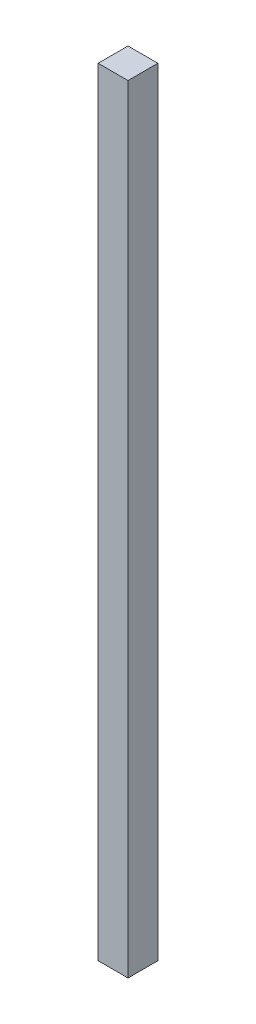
from build123d import *

# Parameters (mm, degrees)
CROQUIS1_W              = 12
CROQUIS1_H              = 312
SALIENTE_EXTRUIR1_DEPTH = 12


with BuildPart() as part:
    # Croquis1 → Saliente-Extruir1 (new body)
    with BuildSketch(Plane.XY):
        with Locations((6, 156)):
            Rectangle(CROQUIS1_W, CROQUIS1_H)
    extrude(amount=SALIENTE_EXTRUIR1_DEPTH)


solid = part.part
